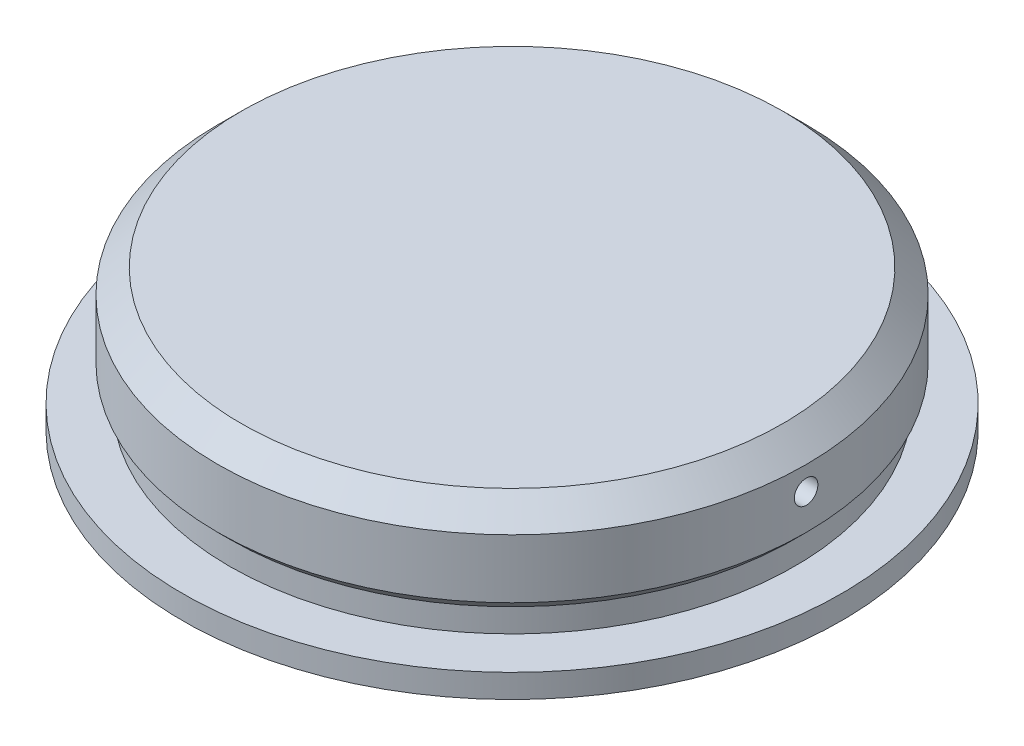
ISO-10303-21;
HEADER;
FILE_DESCRIPTION(('STEP AP214'),'2;1');
FILE_NAME('part.step','',(''),(''),'','','');
FILE_SCHEMA(('AUTOMOTIVE_DESIGN { 1 0 10303 214 1 1 1 1 }'));
ENDSEC;
DATA;
#1=APPLICATION_CONTEXT('core data for automotive mechanical design processes');
#2=APPLICATION_PROTOCOL_DEFINITION('international standard','automotive_design',2000,#1);
#3=PRODUCT_CONTEXT('',#1,'mechanical');
#4=PRODUCT('Part','Part','',(#3));
#5=PRODUCT_RELATED_PRODUCT_CATEGORY('part','',(#4));
#6=PRODUCT_DEFINITION_FORMATION('','',#4);
#7=PRODUCT_DEFINITION_CONTEXT('part definition',#1,'design');
#8=PRODUCT_DEFINITION('design','',#6,#7);
#9=PRODUCT_DEFINITION_SHAPE('','',#8);
#10=(LENGTH_UNIT() NAMED_UNIT(*) SI_UNIT(.MILLI.,.METRE.));
#11=(NAMED_UNIT(*) PLANE_ANGLE_UNIT() SI_UNIT($,.RADIAN.));
#12=(NAMED_UNIT(*) SI_UNIT($,.STERADIAN.) SOLID_ANGLE_UNIT());
#13=UNCERTAINTY_MEASURE_WITH_UNIT(LENGTH_MEASURE(1.E-05),#10,'distance_accuracy_value','');
#14=(GEOMETRIC_REPRESENTATION_CONTEXT(3) GLOBAL_UNCERTAINTY_ASSIGNED_CONTEXT((#13)) GLOBAL_UNIT_ASSIGNED_CONTEXT((#10,
#11,#12)) REPRESENTATION_CONTEXT('',''));
#15=CARTESIAN_POINT('',(0.,0.,0.));
#16=DIRECTION('',(0.,0.,1.));
#17=DIRECTION('',(1.,0.,0.));
#18=AXIS2_PLACEMENT_3D('',#15,#16,#17);
#19=CARTESIAN_POINT('',(0.,0.,0.));
#20=DIRECTION('',(0.,-1.,0.));
#21=DIRECTION('',(0.,0.,-1.));
#22=AXIS2_PLACEMENT_3D('',#19,#20,#21);
#23=CYLINDRICAL_SURFACE('',#22,12.5);
#24=CARTESIAN_POINT('',(-12.4899959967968,4.,0.500000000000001));
#25=CARTESIAN_POINT('',(-12.4899961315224,3.97192683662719,0.499998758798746));
#26=CARTESIAN_POINT('',(-12.4900916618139,3.94383360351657,0.497627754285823));
#27=CARTESIAN_POINT('',(-12.4904635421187,3.88842166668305,0.488202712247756));
#28=CARTESIAN_POINT('',(-12.4907401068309,3.86110392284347,0.481143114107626));
#29=CARTESIAN_POINT('',(-12.4914426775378,3.80805371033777,0.462542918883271));
#30=CARTESIAN_POINT('',(-12.4918686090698,3.78232045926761,0.451004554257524));
#31=CARTESIAN_POINT('',(-12.4928218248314,3.73316320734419,0.423777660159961));
#32=CARTESIAN_POINT('',(-12.4933490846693,3.70973865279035,0.408090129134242));
#33=CARTESIAN_POINT('',(-12.4944459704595,3.66584024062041,0.372997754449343));
#34=CARTESIAN_POINT('',(-12.4950156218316,3.64536817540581,0.353590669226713));
#35=CARTESIAN_POINT('',(-12.4961328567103,3.60797107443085,0.311614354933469));
#36=CARTESIAN_POINT('',(-12.4966804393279,3.59104618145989,0.289044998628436));
#37=CARTESIAN_POINT('',(-12.4976919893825,3.56121971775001,0.241376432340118));
#38=CARTESIAN_POINT('',(-12.4981559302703,3.54831942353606,0.216276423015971));
#39=CARTESIAN_POINT('',(-12.4989476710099,3.52691657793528,0.164264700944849));
#40=CARTESIAN_POINT('',(-12.4992754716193,3.51841400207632,0.137352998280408));
#41=CARTESIAN_POINT('',(-12.4997578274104,3.50605235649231,0.082497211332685));
#42=CARTESIAN_POINT('',(-12.4999124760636,3.50219078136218,0.0545536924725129));
#43=CARTESIAN_POINT('',(-12.5000314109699,3.49921302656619,-0.00158535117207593));
#44=CARTESIAN_POINT('',(-12.4999956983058,3.50009681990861,-0.0297808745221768));
#45=CARTESIAN_POINT('',(-12.4997380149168,3.50658262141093,-0.0856065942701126));
#46=CARTESIAN_POINT('',(-12.4995161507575,3.51218193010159,-0.11323710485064));
#47=CARTESIAN_POINT('',(-12.4989112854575,3.52793563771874,-0.167165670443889));
#48=CARTESIAN_POINT('',(-12.4985282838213,3.53809005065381,-0.193463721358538));
#49=CARTESIAN_POINT('',(-12.4976441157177,3.56266880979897,-0.243989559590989));
#50=CARTESIAN_POINT('',(-12.4971429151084,3.57709439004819,-0.268216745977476));
#51=CARTESIAN_POINT('',(-12.4960788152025,3.60980508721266,-0.313906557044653));
#52=CARTESIAN_POINT('',(-12.4955159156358,3.62809022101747,-0.335369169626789));
#53=CARTESIAN_POINT('',(-12.4943913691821,3.66801624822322,-0.374936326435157));
#54=CARTESIAN_POINT('',(-12.4938297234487,3.68965948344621,-0.393038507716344));
#55=CARTESIAN_POINT('',(-12.492771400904,3.73567909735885,-0.425352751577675));
#56=CARTESIAN_POINT('',(-12.4922747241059,3.76005547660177,-0.439564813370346));
#57=CARTESIAN_POINT('',(-12.4914023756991,3.81085079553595,-0.463695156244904));
#58=CARTESIAN_POINT('',(-12.491026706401,3.83726977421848,-0.473613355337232));
#59=CARTESIAN_POINT('',(-12.490438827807,3.89139973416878,-0.488872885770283));
#60=CARTESIAN_POINT('',(-12.4902266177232,3.91911070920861,-0.494214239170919));
#61=CARTESIAN_POINT('',(-12.4899897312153,3.97501747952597,-0.500165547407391));
#62=CARTESIAN_POINT('',(-12.4899649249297,4.00321292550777,-0.500778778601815));
#63=CARTESIAN_POINT('',(-12.490105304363,4.0593063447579,-0.497264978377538));
#64=CARTESIAN_POINT('',(-12.4902704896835,4.08720431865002,-0.493137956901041));
#65=CARTESIAN_POINT('',(-12.4907721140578,4.14190170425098,-0.480263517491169));
#66=CARTESIAN_POINT('',(-12.4911084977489,4.16870146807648,-0.471517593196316));
#67=CARTESIAN_POINT('',(-12.4919145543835,4.22045251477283,-0.449655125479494));
#68=CARTESIAN_POINT('',(-12.4923842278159,4.24540379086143,-0.436538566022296));
#69=CARTESIAN_POINT('',(-12.4934042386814,4.29276467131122,-0.406298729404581));
#70=CARTESIAN_POINT('',(-12.4939546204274,4.31517286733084,-0.38917324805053));
#71=CARTESIAN_POINT('',(-12.4950738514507,4.35679734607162,-0.351404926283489));
#72=CARTESIAN_POINT('',(-12.4956427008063,4.3760136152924,-0.330762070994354));
#73=CARTESIAN_POINT('',(-12.4967351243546,4.41071973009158,-0.286530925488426));
#74=CARTESIAN_POINT('',(-12.4972586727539,4.42620746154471,-0.26294097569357));
#75=CARTESIAN_POINT('',(-12.4982011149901,4.45300241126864,-0.213493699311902));
#76=CARTESIAN_POINT('',(-12.4986200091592,4.46430964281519,-0.187636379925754));
#77=CARTESIAN_POINT('',(-12.4993058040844,4.48241891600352,-0.134396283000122));
#78=CARTESIAN_POINT('',(-12.4995727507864,4.48922231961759,-0.107013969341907));
#79=CARTESIAN_POINT('',(-12.4999247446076,4.49813527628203,-0.0514946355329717));
#80=CARTESIAN_POINT('',(-12.5000097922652,4.50024484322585,-0.0233576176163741));
#81=CARTESIAN_POINT('',(-12.4999884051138,4.49971009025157,0.0328513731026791));
#82=CARTESIAN_POINT('',(-12.4998821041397,4.49706909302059,0.0609233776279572));
#83=CARTESIAN_POINT('',(-12.4994902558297,4.48711503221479,0.116225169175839));
#84=CARTESIAN_POINT('',(-12.4992047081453,4.47980195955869,0.14345495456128));
#85=CARTESIAN_POINT('',(-12.4984865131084,4.4607119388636,0.196300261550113));
#86=CARTESIAN_POINT('',(-12.4980538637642,4.44893493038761,0.221915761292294));
#87=CARTESIAN_POINT('',(-12.4970901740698,4.42125210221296,0.270805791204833));
#88=CARTESIAN_POINT('',(-12.496559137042,4.40534642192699,0.294080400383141));
#89=CARTESIAN_POINT('',(-12.4954580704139,4.36984651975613,0.337644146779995));
#90=CARTESIAN_POINT('',(-12.4948880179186,4.35025012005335,0.357931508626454));
#91=CARTESIAN_POINT('',(-12.4937732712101,4.30792388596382,0.394934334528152));
#92=CARTESIAN_POINT('',(-12.4932285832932,4.28519327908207,0.411648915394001));
#93=CARTESIAN_POINT('',(-12.4922257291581,4.23723106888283,0.441036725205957));
#94=CARTESIAN_POINT('',(-12.4917676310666,4.21199751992,0.453706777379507));
#95=CARTESIAN_POINT('',(-12.4909907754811,4.15977875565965,0.474615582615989));
#96=CARTESIAN_POINT('',(-12.4906718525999,4.13279566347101,0.482859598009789));
#97=CARTESIAN_POINT('',(-12.4902942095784,4.08803611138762,0.492507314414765));
#98=CARTESIAN_POINT('',(-12.4901828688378,4.07054991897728,0.495313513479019));
#99=CARTESIAN_POINT('',(-12.490033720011,4.0353784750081,0.499060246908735));
#100=CARTESIAN_POINT('',(-12.4899959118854,4.01769322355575,0.500000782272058));
#101=CARTESIAN_POINT('',(-12.4899959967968,4.,0.500000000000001));
#102=B_SPLINE_CURVE_WITH_KNOTS('',3,(#24,#25,#26,#27,#28,#29,#30,#31,#32,#33,#34,#35,#36,#37,
#38,#39,#40,#41,#42,#43,#44,#45,#46,#47,#48,#49,#50,#51,#52,#53,#54,#55,#56,#57,#58,#59,#60,#61,
#62,#63,#64,#65,#66,#67,#68,#69,#70,#71,#72,#73,#74,#75,#76,#77,#78,#79,#80,#81,#82,#83,#84,#85,
#86,#87,#88,#89,#90,#91,#92,#93,#94,#95,#96,#97,#98,#99,#100,#101),.UNSPECIFIED.,.T.,.F.,(4,2,2,
2,2,2,2,2,2,2,2,2,2,2,2,2,2,2,2,2,2,2,2,2,2,2,2,2,2,2,2,2,2,2,2,2,2,2,4),(0.,0.0841549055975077,
0.168409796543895,0.252622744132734,0.336815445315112,0.421059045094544,0.50530603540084,
0.589579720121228,0.673852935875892,0.758080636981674,0.842307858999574,0.926486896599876,
1.01066619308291,1.09486983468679,1.17907384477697,1.26333684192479,1.34759985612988,
1.43186447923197,1.51612869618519,1.60033451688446,1.68454016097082,1.76871859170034,
1.85289733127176,1.93712246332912,2.02134795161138,2.10562108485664,2.18989395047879,
2.27414132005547,2.35838844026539,2.44257665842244,2.52676504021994,2.61095456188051,
2.69514124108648,2.77937775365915,2.86363506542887,2.94795839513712,3.03218124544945,
3.08522023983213,3.13825920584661),.UNSPECIFIED.);
#103=CARTESIAN_POINT('',(-12.4899959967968,4.,0.500000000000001));
#104=VERTEX_POINT('',#103);
#105=EDGE_CURVE('E60',#104,#104,#102,.T.);
#106=ORIENTED_EDGE('',*,*,#105,.T.);
#107=EDGE_LOOP('',(#106));
#108=FACE_BOUND('',#107,.T.);
#109=CARTESIAN_POINT('',(0.,5.00000000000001,0.));
#110=DIRECTION('',(0.,-1.,0.));
#111=DIRECTION('',(0.,0.,-1.));
#112=AXIS2_PLACEMENT_3D('',#109,#110,#111);
#113=CIRCLE('',#112,12.5);
#114=CARTESIAN_POINT('',(0.,5.00000000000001,-12.5));
#115=VERTEX_POINT('',#114);
#116=EDGE_CURVE('E52',#115,#115,#113,.T.);
#117=ORIENTED_EDGE('',*,*,#116,.T.);
#118=EDGE_LOOP('',(#117));
#119=FACE_BOUND('',#118,.T.);
#120=CARTESIAN_POINT('',(0.,2.50000000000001,0.));
#121=DIRECTION('',(0.,-1.,0.));
#122=DIRECTION('',(0.,0.,-1.));
#123=AXIS2_PLACEMENT_3D('',#120,#121,#122);
#124=CIRCLE('',#123,12.5);
#125=CARTESIAN_POINT('',(0.,2.50000000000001,-12.5));
#126=VERTEX_POINT('',#125);
#127=EDGE_CURVE('E57',#126,#126,#124,.T.);
#128=ORIENTED_EDGE('',*,*,#127,.F.);
#129=EDGE_LOOP('',(#128));
#130=FACE_BOUND('',#129,.T.);
#131=CARTESIAN_POINT('',(12.4899959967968,4.,0.500000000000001));
#132=CARTESIAN_POINT('',(12.4899961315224,4.02807316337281,0.499998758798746));
#133=CARTESIAN_POINT('',(12.4900916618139,4.05616639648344,0.497627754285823));
#134=CARTESIAN_POINT('',(12.4904635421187,4.11157833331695,0.488202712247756));
#135=CARTESIAN_POINT('',(12.4907401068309,4.13889607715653,0.481143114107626));
#136=CARTESIAN_POINT('',(12.4914426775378,4.19194628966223,0.462542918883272));
#137=CARTESIAN_POINT('',(12.4918686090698,4.2176795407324,0.451004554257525));
#138=CARTESIAN_POINT('',(12.4928218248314,4.26683679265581,0.423777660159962));
#139=CARTESIAN_POINT('',(12.4933490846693,4.29026134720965,0.408090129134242));
#140=CARTESIAN_POINT('',(12.4944459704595,4.3341597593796,0.372997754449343));
#141=CARTESIAN_POINT('',(12.4950156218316,4.3546318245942,0.353590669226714));
#142=CARTESIAN_POINT('',(12.4961328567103,4.39202892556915,0.311614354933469));
#143=CARTESIAN_POINT('',(12.4966804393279,4.40895381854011,0.289044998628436));
#144=CARTESIAN_POINT('',(12.4976919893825,4.43878028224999,0.241376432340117));
#145=CARTESIAN_POINT('',(12.4981559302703,4.45168057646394,0.216276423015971));
#146=CARTESIAN_POINT('',(12.4989476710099,4.47308342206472,0.164264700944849));
#147=CARTESIAN_POINT('',(12.4992754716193,4.48158599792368,0.137352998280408));
#148=CARTESIAN_POINT('',(12.4997578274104,4.49394764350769,0.0824972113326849));
#149=CARTESIAN_POINT('',(12.4999124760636,4.49780921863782,0.0545536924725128));
#150=CARTESIAN_POINT('',(12.5000314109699,4.50078697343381,-0.00158535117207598));
#151=CARTESIAN_POINT('',(12.4999956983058,4.49990318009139,-0.0297808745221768));
#152=CARTESIAN_POINT('',(12.4997380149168,4.49341737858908,-0.0856065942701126));
#153=CARTESIAN_POINT('',(12.4995161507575,4.48781806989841,-0.11323710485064));
#154=CARTESIAN_POINT('',(12.4989112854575,4.47206436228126,-0.167165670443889));
#155=CARTESIAN_POINT('',(12.4985282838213,4.46190994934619,-0.193463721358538));
#156=CARTESIAN_POINT('',(12.4976441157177,4.43733119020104,-0.243989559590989));
#157=CARTESIAN_POINT('',(12.4971429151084,4.42290560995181,-0.268216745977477));
#158=CARTESIAN_POINT('',(12.4960788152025,4.39019491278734,-0.313906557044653));
#159=CARTESIAN_POINT('',(12.4955159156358,4.37190977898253,-0.335369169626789));
#160=CARTESIAN_POINT('',(12.4943913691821,4.33198375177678,-0.374936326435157));
#161=CARTESIAN_POINT('',(12.4938297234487,4.3103405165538,-0.393038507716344));
#162=CARTESIAN_POINT('',(12.492771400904,4.26432090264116,-0.425352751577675));
#163=CARTESIAN_POINT('',(12.4922747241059,4.23994452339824,-0.439564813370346));
#164=CARTESIAN_POINT('',(12.4914023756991,4.18914920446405,-0.463695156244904));
#165=CARTESIAN_POINT('',(12.491026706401,4.16273022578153,-0.473613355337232));
#166=CARTESIAN_POINT('',(12.490438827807,4.10860026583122,-0.488872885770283));
#167=CARTESIAN_POINT('',(12.4902266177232,4.0808892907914,-0.494214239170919));
#168=CARTESIAN_POINT('',(12.4899897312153,4.02498252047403,-0.500165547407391));
#169=CARTESIAN_POINT('',(12.4899649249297,3.99678707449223,-0.500778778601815));
#170=CARTESIAN_POINT('',(12.490105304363,3.94069365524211,-0.497264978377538));
#171=CARTESIAN_POINT('',(12.4902704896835,3.91279568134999,-0.493137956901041));
#172=CARTESIAN_POINT('',(12.4907721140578,3.85809829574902,-0.480263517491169));
#173=CARTESIAN_POINT('',(12.4911084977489,3.83129853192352,-0.471517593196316));
#174=CARTESIAN_POINT('',(12.4919145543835,3.77954748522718,-0.449655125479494));
#175=CARTESIAN_POINT('',(12.4923842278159,3.75459620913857,-0.436538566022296));
#176=CARTESIAN_POINT('',(12.4934042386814,3.70723532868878,-0.406298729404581));
#177=CARTESIAN_POINT('',(12.4939546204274,3.68482713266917,-0.38917324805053));
#178=CARTESIAN_POINT('',(12.4950738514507,3.64320265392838,-0.351404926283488));
#179=CARTESIAN_POINT('',(12.4956427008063,3.6239863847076,-0.330762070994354));
#180=CARTESIAN_POINT('',(12.4967351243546,3.58928026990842,-0.286530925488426));
#181=CARTESIAN_POINT('',(12.4972586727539,3.57379253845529,-0.26294097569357));
#182=CARTESIAN_POINT('',(12.4982011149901,3.54699758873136,-0.213493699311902));
#183=CARTESIAN_POINT('',(12.4986200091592,3.53569035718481,-0.187636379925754));
#184=CARTESIAN_POINT('',(12.4993058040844,3.51758108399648,-0.134396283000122));
#185=CARTESIAN_POINT('',(12.4995727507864,3.51077768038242,-0.107013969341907));
#186=CARTESIAN_POINT('',(12.4999247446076,3.50186472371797,-0.0514946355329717));
#187=CARTESIAN_POINT('',(12.5000097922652,3.49975515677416,-0.0233576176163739));
#188=CARTESIAN_POINT('',(12.4999884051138,3.50028990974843,0.0328513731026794));
#189=CARTESIAN_POINT('',(12.4998821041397,3.50293090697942,0.0609233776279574));
#190=CARTESIAN_POINT('',(12.4994902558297,3.51288496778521,0.116225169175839));
#191=CARTESIAN_POINT('',(12.4992047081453,3.52019804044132,0.14345495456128));
#192=CARTESIAN_POINT('',(12.4984865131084,3.5392880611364,0.196300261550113));
#193=CARTESIAN_POINT('',(12.4980538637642,3.55106506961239,0.221915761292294));
#194=CARTESIAN_POINT('',(12.4970901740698,3.57874789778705,0.270805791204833));
#195=CARTESIAN_POINT('',(12.496559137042,3.59465357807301,0.29408040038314));
#196=CARTESIAN_POINT('',(12.4954580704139,3.63015348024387,0.337644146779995));
#197=CARTESIAN_POINT('',(12.4948880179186,3.64974987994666,0.357931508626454));
#198=CARTESIAN_POINT('',(12.4937732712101,3.69207611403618,0.394934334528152));
#199=CARTESIAN_POINT('',(12.4932285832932,3.71480672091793,0.411648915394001));
#200=CARTESIAN_POINT('',(12.4922257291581,3.76276893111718,0.441036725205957));
#201=CARTESIAN_POINT('',(12.4917676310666,3.78800248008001,0.453706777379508));
#202=CARTESIAN_POINT('',(12.4909907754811,3.84022124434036,0.474615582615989));
#203=CARTESIAN_POINT('',(12.4906718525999,3.86720433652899,0.48285959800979));
#204=CARTESIAN_POINT('',(12.4902942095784,3.91196388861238,0.492507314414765));
#205=CARTESIAN_POINT('',(12.4901828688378,3.92945008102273,0.495313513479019));
#206=CARTESIAN_POINT('',(12.490033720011,3.9646215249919,0.499060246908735));
#207=CARTESIAN_POINT('',(12.4899959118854,3.98230677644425,0.500000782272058));
#208=CARTESIAN_POINT('',(12.4899959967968,4.,0.500000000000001));
#209=B_SPLINE_CURVE_WITH_KNOTS('',3,(#131,#132,#133,#134,#135,#136,#137,#138,#139,#140,#141,
#142,#143,#144,#145,#146,#147,#148,#149,#150,#151,#152,#153,#154,#155,#156,#157,#158,#159,#160,
#161,#162,#163,#164,#165,#166,#167,#168,#169,#170,#171,#172,#173,#174,#175,#176,#177,#178,#179,
#180,#181,#182,#183,#184,#185,#186,#187,#188,#189,#190,#191,#192,#193,#194,#195,#196,#197,#198,
#199,#200,#201,#202,#203,#204,#205,#206,#207,#208),.UNSPECIFIED.,.T.,.F.,(4,2,2,2,2,2,2,2,2,2,2,
2,2,2,2,2,2,2,2,2,2,2,2,2,2,2,2,2,2,2,2,2,2,2,2,2,2,2,4),(0.,0.0841549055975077,
0.168409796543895,0.252622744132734,0.336815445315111,0.421059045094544,0.505306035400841,
0.589579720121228,0.673852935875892,0.758080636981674,0.842307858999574,0.926486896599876,
1.01066619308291,1.09486983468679,1.17907384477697,1.26333684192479,1.34759985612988,
1.43186447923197,1.51612869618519,1.60033451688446,1.68454016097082,1.76871859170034,
1.85289733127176,1.93712246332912,2.02134795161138,2.10562108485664,2.18989395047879,
2.27414132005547,2.35838844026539,2.44257665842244,2.52676504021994,2.61095456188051,
2.69514124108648,2.77937775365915,2.86363506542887,2.94795839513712,3.03218124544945,
3.08522023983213,3.13825920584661),.UNSPECIFIED.);
#210=CARTESIAN_POINT('',(12.4899959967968,4.,0.500000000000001));
#211=VERTEX_POINT('',#210);
#212=EDGE_CURVE('E43',#211,#211,#209,.T.);
#213=ORIENTED_EDGE('',*,*,#212,.T.);
#214=EDGE_LOOP('',(#213));
#215=FACE_BOUND('',#214,.T.);
#216=ADVANCED_FACE('F39',(#108,#119,#130,#215),#23,.T.);
#217=CARTESIAN_POINT('',(0.,6.,0.));
#218=DIRECTION('',(0.,1.,0.));
#219=DIRECTION('',(0.,0.,1.));
#220=AXIS2_PLACEMENT_3D('',#217,#218,#219);
#221=PLANE('',#220);
#222=CARTESIAN_POINT('',(0.,6.,0.));
#223=DIRECTION('',(0.,-1.,0.));
#224=DIRECTION('',(0.,0.,-1.));
#225=AXIS2_PLACEMENT_3D('',#222,#223,#224);
#226=CIRCLE('',#225,11.5);
#227=CARTESIAN_POINT('',(0.,6.,-11.5));
#228=VERTEX_POINT('',#227);
#229=EDGE_CURVE('E11',#228,#228,#226,.T.);
#230=ORIENTED_EDGE('',*,*,#229,.F.);
#231=EDGE_LOOP('',(#230));
#232=FACE_BOUND('',#231,.T.);
#233=ADVANCED_FACE('F41',(#232),#221,.T.);
#234=CARTESIAN_POINT('',(0.,5.00000000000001,0.));
#235=DIRECTION('',(0.,-1.,0.));
#236=DIRECTION('',(0.,0.,-1.));
#237=AXIS2_PLACEMENT_3D('',#234,#235,#236);
#238=CONICAL_SURFACE('',#237,12.5,0.785398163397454);
#239=ORIENTED_EDGE('',*,*,#229,.T.);
#240=EDGE_LOOP('',(#239));
#241=FACE_BOUND('',#240,.T.);
#242=ORIENTED_EDGE('',*,*,#116,.F.);
#243=EDGE_LOOP('',(#242));
#244=FACE_BOUND('',#243,.T.);
#245=ADVANCED_FACE('F90',(#241,#244),#238,.T.);
#246=CARTESIAN_POINT('',(0.,2.,0.));
#247=DIRECTION('',(0.,1.,0.));
#248=DIRECTION('',(0.,0.,1.));
#249=AXIS2_PLACEMENT_3D('',#246,#247,#248);
#250=CONICAL_SURFACE('',#249,12.,0.785398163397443);
#251=ORIENTED_EDGE('',*,*,#127,.T.);
#252=EDGE_LOOP('',(#251));
#253=FACE_BOUND('',#252,.T.);
#254=CARTESIAN_POINT('',(0.,2.,0.));
#255=DIRECTION('',(0.,-1.,0.));
#256=DIRECTION('',(0.,0.,-1.));
#257=AXIS2_PLACEMENT_3D('',#254,#255,#256);
#258=CIRCLE('',#257,12.);
#259=CARTESIAN_POINT('',(0.,2.,-12.));
#260=VERTEX_POINT('',#259);
#261=EDGE_CURVE('E122',#260,#260,#258,.T.);
#262=ORIENTED_EDGE('',*,*,#261,.F.);
#263=EDGE_LOOP('',(#262));
#264=FACE_BOUND('',#263,.T.);
#265=ADVANCED_FACE('F87',(#253,#264),#250,.T.);
#266=CARTESIAN_POINT('',(0.,0.,0.));
#267=DIRECTION('',(0.,-1.,0.));
#268=DIRECTION('',(0.,0.,-1.));
#269=AXIS2_PLACEMENT_3D('',#266,#267,#268);
#270=CYLINDRICAL_SURFACE('',#269,12.);
#271=ORIENTED_EDGE('',*,*,#261,.T.);
#272=EDGE_LOOP('',(#271));
#273=FACE_BOUND('',#272,.T.);
#274=CARTESIAN_POINT('',(0.,1.,0.));
#275=DIRECTION('',(0.,-1.,0.));
#276=DIRECTION('',(0.,0.,-1.));
#277=AXIS2_PLACEMENT_3D('',#274,#275,#276);
#278=CIRCLE('',#277,12.);
#279=CARTESIAN_POINT('',(0.,1.,-12.));
#280=VERTEX_POINT('',#279);
#281=EDGE_CURVE('E117',#280,#280,#278,.T.);
#282=ORIENTED_EDGE('',*,*,#281,.F.);
#283=EDGE_LOOP('',(#282));
#284=FACE_BOUND('',#283,.T.);
#285=ADVANCED_FACE('F84',(#273,#284),#270,.T.);
#286=CARTESIAN_POINT('',(12.,1.,0.));
#287=DIRECTION('',(0.,1.,0.));
#288=DIRECTION('',(0.,0.,1.));
#289=AXIS2_PLACEMENT_3D('',#286,#287,#288);
#290=PLANE('',#289);
#291=ORIENTED_EDGE('',*,*,#281,.T.);
#292=EDGE_LOOP('',(#291));
#293=FACE_BOUND('',#292,.T.);
#294=CARTESIAN_POINT('',(0.,1.,0.));
#295=DIRECTION('',(0.,-1.,0.));
#296=DIRECTION('',(0.,0.,-1.));
#297=AXIS2_PLACEMENT_3D('',#294,#295,#296);
#298=CIRCLE('',#297,14.);
#299=CARTESIAN_POINT('',(0.,1.,-14.));
#300=VERTEX_POINT('',#299);
#301=EDGE_CURVE('E113',#300,#300,#298,.T.);
#302=ORIENTED_EDGE('',*,*,#301,.F.);
#303=EDGE_LOOP('',(#302));
#304=FACE_BOUND('',#303,.T.);
#305=ADVANCED_FACE('F80',(#293,#304),#290,.T.);
#306=CARTESIAN_POINT('',(0.,0.,0.));
#307=DIRECTION('',(0.,-1.,0.));
#308=DIRECTION('',(0.,0.,-1.));
#309=AXIS2_PLACEMENT_3D('',#306,#307,#308);
#310=CYLINDRICAL_SURFACE('',#309,14.);
#311=ORIENTED_EDGE('',*,*,#301,.T.);
#312=EDGE_LOOP('',(#311));
#313=FACE_BOUND('',#312,.T.);
#314=CARTESIAN_POINT('',(0.,0.,0.));
#315=DIRECTION('',(0.,-1.,0.));
#316=DIRECTION('',(0.,0.,-1.));
#317=AXIS2_PLACEMENT_3D('',#314,#315,#316);
#318=CIRCLE('',#317,14.);
#319=CARTESIAN_POINT('',(0.,0.,-14.));
#320=VERTEX_POINT('',#319);
#321=EDGE_CURVE('E111',#320,#320,#318,.T.);
#322=ORIENTED_EDGE('',*,*,#321,.F.);
#323=EDGE_LOOP('',(#322));
#324=FACE_BOUND('',#323,.T.);
#325=ADVANCED_FACE('F76',(#313,#324),#310,.T.);
#326=CARTESIAN_POINT('',(0.,0.,0.));
#327=DIRECTION('',(0.,-1.,0.));
#328=DIRECTION('',(0.,0.,-1.));
#329=AXIS2_PLACEMENT_3D('',#326,#327,#328);
#330=PLANE('',#329);
#331=ORIENTED_EDGE('',*,*,#321,.T.);
#332=EDGE_LOOP('',(#331));
#333=FACE_BOUND('',#332,.T.);
#334=ADVANCED_FACE('F71',(#333),#330,.T.);
#335=CARTESIAN_POINT('',(15.,4.,0.));
#336=DIRECTION('',(-1.,0.,0.));
#337=DIRECTION('',(0.,0.,1.));
#338=AXIS2_PLACEMENT_3D('',#335,#336,#337);
#339=CYLINDRICAL_SURFACE('',#338,0.500000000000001);
#340=ORIENTED_EDGE('',*,*,#212,.F.);
#341=EDGE_LOOP('',(#340));
#342=FACE_BOUND('',#341,.T.);
#343=ORIENTED_EDGE('',*,*,#105,.F.);
#344=EDGE_LOOP('',(#343));
#345=FACE_BOUND('',#344,.T.);
#346=ADVANCED_FACE('F67',(#342,#345),#339,.F.);
#347=CLOSED_SHELL('',(#216,#233,#245,#265,#285,#305,#325,#334,#346));
#348=MANIFOLD_SOLID_BREP('B2',#347);
#349=ADVANCED_BREP_SHAPE_REPRESENTATION('',(#18,#348),#14);
#350=SHAPE_DEFINITION_REPRESENTATION(#9,#349);
ENDSEC;
END-ISO-10303-21;
